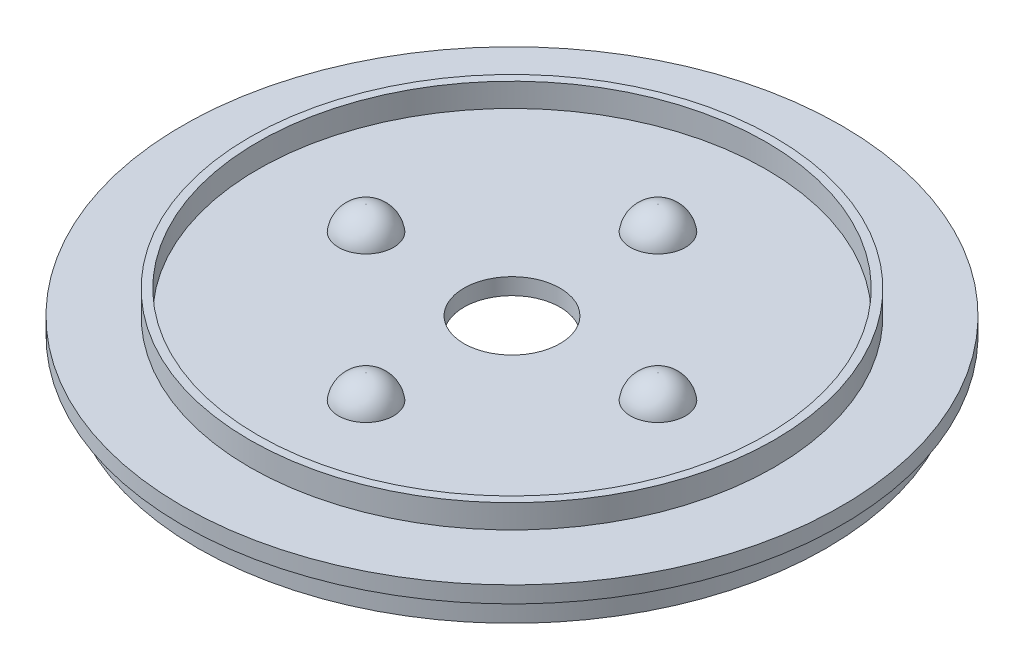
ISO-10303-21;
HEADER;
FILE_DESCRIPTION(('STEP AP214'),'2;1');
FILE_NAME('part.step','',(''),(''),'','','');
FILE_SCHEMA(('AUTOMOTIVE_DESIGN { 1 0 10303 214 1 1 1 1 }'));
ENDSEC;
DATA;
#1=APPLICATION_CONTEXT('core data for automotive mechanical design processes');
#2=APPLICATION_PROTOCOL_DEFINITION('international standard','automotive_design',2000,#1);
#3=PRODUCT_CONTEXT('',#1,'mechanical');
#4=PRODUCT('Part','Part','',(#3));
#5=PRODUCT_RELATED_PRODUCT_CATEGORY('part','',(#4));
#6=PRODUCT_DEFINITION_FORMATION('','',#4);
#7=PRODUCT_DEFINITION_CONTEXT('part definition',#1,'design');
#8=PRODUCT_DEFINITION('design','',#6,#7);
#9=PRODUCT_DEFINITION_SHAPE('','',#8);
#10=(LENGTH_UNIT() NAMED_UNIT(*) SI_UNIT(.MILLI.,.METRE.));
#11=(NAMED_UNIT(*) PLANE_ANGLE_UNIT() SI_UNIT($,.RADIAN.));
#12=(NAMED_UNIT(*) SI_UNIT($,.STERADIAN.) SOLID_ANGLE_UNIT());
#13=UNCERTAINTY_MEASURE_WITH_UNIT(LENGTH_MEASURE(1.E-05),#10,'distance_accuracy_value','');
#14=(GEOMETRIC_REPRESENTATION_CONTEXT(3) GLOBAL_UNCERTAINTY_ASSIGNED_CONTEXT((#13)) GLOBAL_UNIT_ASSIGNED_CONTEXT((#10,
#11,#12)) REPRESENTATION_CONTEXT('',''));
#15=CARTESIAN_POINT('',(0.,0.,0.));
#16=DIRECTION('',(0.,0.,1.));
#17=DIRECTION('',(1.,0.,0.));
#18=AXIS2_PLACEMENT_3D('',#15,#16,#17);
#19=CARTESIAN_POINT('',(0.,3.,0.));
#20=DIRECTION('',(0.,1.,0.));
#21=DIRECTION('',(0.,0.,1.));
#22=AXIS2_PLACEMENT_3D('',#19,#20,#21);
#23=PLANE('',#22);
#24=CARTESIAN_POINT('',(-26.5749612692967,3.,7.5014331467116E-13));
#25=DIRECTION('',(0.,1.,0.));
#26=DIRECTION('',(0.,0.,1.));
#27=AXIS2_PLACEMENT_3D('',#24,#25,#26);
#28=CIRCLE('',#27,5.00000000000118);
#29=CARTESIAN_POINT('',(-26.5749612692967,3.,5.00000000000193));
#30=VERTEX_POINT('',#29);
#31=EDGE_CURVE('E139',#30,#30,#28,.T.);
#32=ORIENTED_EDGE('',*,*,#31,.F.);
#33=EDGE_LOOP('',(#32));
#34=FACE_BOUND('',#33,.T.);
#35=CARTESIAN_POINT('',(1.49377764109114E-12,3.,26.5749612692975));
#36=DIRECTION('',(0.,1.,0.));
#37=DIRECTION('',(0.,0.,1.));
#38=AXIS2_PLACEMENT_3D('',#35,#36,#37);
#39=CIRCLE('',#38,5.00000000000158);
#40=CARTESIAN_POINT('',(1.49377764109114E-12,3.,31.574961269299));
#41=VERTEX_POINT('',#40);
#42=EDGE_CURVE('E135',#41,#41,#39,.T.);
#43=ORIENTED_EDGE('',*,*,#42,.F.);
#44=EDGE_LOOP('',(#43));
#45=FACE_BOUND('',#44,.T.);
#46=CARTESIAN_POINT('',(26.5749612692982,3.,-7.46888820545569E-13));
#47=DIRECTION('',(0.,1.,0.));
#48=DIRECTION('',(0.,0.,1.));
#49=AXIS2_PLACEMENT_3D('',#46,#47,#48);
#50=CIRCLE('',#49,5.00000000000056);
#51=CARTESIAN_POINT('',(26.5749612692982,3.,4.99999999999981));
#52=VERTEX_POINT('',#51);
#53=EDGE_CURVE('E131',#52,#52,#50,.T.);
#54=ORIENTED_EDGE('',*,*,#53,.F.);
#55=EDGE_LOOP('',(#54));
#56=FACE_BOUND('',#55,.T.);
#57=CARTESIAN_POINT('',(0.,3.,-26.5749612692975));
#58=DIRECTION('',(0.,1.,0.));
#59=DIRECTION('',(0.,0.,1.));
#60=AXIS2_PLACEMENT_3D('',#57,#58,#59);
#61=CIRCLE('',#60,5.);
#62=CARTESIAN_POINT('',(0.,3.,-21.5749612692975));
#63=VERTEX_POINT('',#62);
#64=EDGE_CURVE('E127',#63,#63,#61,.T.);
#65=ORIENTED_EDGE('',*,*,#64,.F.);
#66=EDGE_LOOP('',(#65));
#67=FACE_BOUND('',#66,.T.);
#68=CARTESIAN_POINT('',(0.,3.,0.));
#69=DIRECTION('',(0.,1.,0.));
#70=DIRECTION('',(0.,0.,1.));
#71=AXIS2_PLACEMENT_3D('',#68,#69,#70);
#72=CIRCLE('',#71,8.75);
#73=CARTESIAN_POINT('',(0.,3.,8.75));
#74=VERTEX_POINT('',#73);
#75=EDGE_CURVE('E80',#74,#74,#72,.T.);
#76=ORIENTED_EDGE('',*,*,#75,.F.);
#77=EDGE_LOOP('',(#76));
#78=FACE_BOUND('',#77,.T.);
#79=CARTESIAN_POINT('',(0.,3.,0.));
#80=DIRECTION('',(0.,1.,0.));
#81=DIRECTION('',(0.,0.,1.));
#82=AXIS2_PLACEMENT_3D('',#79,#80,#81);
#83=CIRCLE('',#82,46.25);
#84=CARTESIAN_POINT('',(0.,3.,-46.25));
#85=VERTEX_POINT('',#84);
#86=EDGE_CURVE('E63',#85,#85,#83,.F.);
#87=ORIENTED_EDGE('',*,*,#86,.F.);
#88=EDGE_LOOP('',(#87));
#89=FACE_BOUND('',#88,.T.);
#90=ADVANCED_FACE('F39',(#34,#45,#56,#67,#78,#89),#23,.T.);
#91=CARTESIAN_POINT('',(0.,0.,0.));
#92=DIRECTION('',(0.,1.,0.));
#93=DIRECTION('',(0.,0.,1.));
#94=AXIS2_PLACEMENT_3D('',#91,#92,#93);
#95=PLANE('',#94);
#96=CARTESIAN_POINT('',(0.,0.,0.));
#97=DIRECTION('',(0.,1.,0.));
#98=DIRECTION('',(0.,0.,1.));
#99=AXIS2_PLACEMENT_3D('',#96,#97,#98);
#100=CIRCLE('',#99,8.75);
#101=CARTESIAN_POINT('',(0.,0.,8.75));
#102=VERTEX_POINT('',#101);
#103=EDGE_CURVE('E84',#102,#102,#100,.T.);
#104=ORIENTED_EDGE('',*,*,#103,.T.);
#105=EDGE_LOOP('',(#104));
#106=FACE_BOUND('',#105,.T.);
#107=CARTESIAN_POINT('',(0.,0.,0.));
#108=DIRECTION('',(0.,-1.,0.));
#109=DIRECTION('',(0.,0.,-1.));
#110=AXIS2_PLACEMENT_3D('',#107,#108,#109);
#111=CIRCLE('',#110,20.5);
#112=CARTESIAN_POINT('',(0.,0.,-20.5));
#113=VERTEX_POINT('',#112);
#114=EDGE_CURVE('E108',#113,#113,#111,.T.);
#115=ORIENTED_EDGE('',*,*,#114,.T.);
#116=EDGE_LOOP('',(#115));
#117=FACE_BOUND('',#116,.T.);
#118=ADVANCED_FACE('F148',(#106,#117),#95,.F.);
#119=CARTESIAN_POINT('',(0.,0.,0.));
#120=DIRECTION('',(0.,1.,0.));
#121=DIRECTION('',(0.,0.,1.));
#122=AXIS2_PLACEMENT_3D('',#119,#120,#121);
#123=CIRCLE('',#122,22.);
#124=CARTESIAN_POINT('',(0.,0.,22.));
#125=VERTEX_POINT('',#124);
#126=EDGE_CURVE('E67',#125,#125,#123,.F.);
#127=ORIENTED_EDGE('',*,*,#126,.F.);
#128=EDGE_LOOP('',(#127));
#129=FACE_BOUND('',#128,.T.);
#130=CARTESIAN_POINT('',(0.,0.,0.));
#131=DIRECTION('',(0.,-1.,0.));
#132=DIRECTION('',(0.,0.,-1.));
#133=AXIS2_PLACEMENT_3D('',#130,#131,#132);
#134=CIRCLE('',#133,55.75);
#135=CARTESIAN_POINT('',(0.,0.,-55.75));
#136=VERTEX_POINT('',#135);
#137=EDGE_CURVE('E96',#136,#136,#134,.T.);
#138=ORIENTED_EDGE('',*,*,#137,.T.);
#139=EDGE_LOOP('',(#138));
#140=FACE_BOUND('',#139,.T.);
#141=ADVANCED_FACE('F212',(#129,#140),#95,.F.);
#142=CARTESIAN_POINT('',(0.,3.,0.));
#143=DIRECTION('',(0.,1.,0.));
#144=DIRECTION('',(0.,0.,1.));
#145=AXIS2_PLACEMENT_3D('',#142,#143,#144);
#146=CIRCLE('',#145,47.75);
#147=CARTESIAN_POINT('',(0.,3.,-47.75));
#148=VERTEX_POINT('',#147);
#149=EDGE_CURVE('E116',#148,#148,#146,.T.);
#150=ORIENTED_EDGE('',*,*,#149,.F.);
#151=EDGE_LOOP('',(#150));
#152=FACE_BOUND('',#151,.T.);
#153=CARTESIAN_POINT('',(0.,3.,0.));
#154=DIRECTION('',(0.,1.,0.));
#155=DIRECTION('',(0.,0.,1.));
#156=AXIS2_PLACEMENT_3D('',#153,#154,#155);
#157=CIRCLE('',#156,60.);
#158=CARTESIAN_POINT('',(0.,3.,60.));
#159=VERTEX_POINT('',#158);
#160=EDGE_CURVE('E75',#159,#159,#157,.T.);
#161=ORIENTED_EDGE('',*,*,#160,.T.);
#162=EDGE_LOOP('',(#161));
#163=FACE_BOUND('',#162,.T.);
#164=ADVANCED_FACE('F150',(#152,#163),#23,.T.);
#165=CARTESIAN_POINT('',(0.,0.,0.));
#166=DIRECTION('',(0.,1.,0.));
#167=DIRECTION('',(0.,0.,1.));
#168=AXIS2_PLACEMENT_3D('',#165,#166,#167);
#169=CIRCLE('',#168,57.25);
#170=CARTESIAN_POINT('',(0.,0.,57.25));
#171=VERTEX_POINT('',#170);
#172=EDGE_CURVE('E71',#171,#171,#169,.F.);
#173=ORIENTED_EDGE('',*,*,#172,.F.);
#174=EDGE_LOOP('',(#173));
#175=FACE_BOUND('',#174,.T.);
#176=CARTESIAN_POINT('',(0.,0.,0.));
#177=DIRECTION('',(0.,1.,0.));
#178=DIRECTION('',(0.,0.,1.));
#179=AXIS2_PLACEMENT_3D('',#176,#177,#178);
#180=CIRCLE('',#179,60.);
#181=CARTESIAN_POINT('',(0.,0.,60.));
#182=VERTEX_POINT('',#181);
#183=EDGE_CURVE('E76',#182,#182,#180,.T.);
#184=ORIENTED_EDGE('',*,*,#183,.F.);
#185=EDGE_LOOP('',(#184));
#186=FACE_BOUND('',#185,.T.);
#187=ADVANCED_FACE('F211',(#175,#186),#95,.F.);
#188=CARTESIAN_POINT('',(0.,3.,0.));
#189=DIRECTION('',(0.,-1.,0.));
#190=DIRECTION('',(0.,0.,-1.));
#191=AXIS2_PLACEMENT_3D('',#188,#189,#190);
#192=CYLINDRICAL_SURFACE('',#191,60.);
#193=ORIENTED_EDGE('',*,*,#160,.F.);
#194=EDGE_LOOP('',(#193));
#195=FACE_BOUND('',#194,.T.);
#196=ORIENTED_EDGE('',*,*,#183,.T.);
#197=EDGE_LOOP('',(#196));
#198=FACE_BOUND('',#197,.T.);
#199=ADVANCED_FACE('F207',(#195,#198),#192,.T.);
#200=CARTESIAN_POINT('',(0.,3.,0.));
#201=DIRECTION('',(0.,-1.,0.));
#202=DIRECTION('',(0.,0.,-1.));
#203=AXIS2_PLACEMENT_3D('',#200,#201,#202);
#204=CYLINDRICAL_SURFACE('',#203,8.75);
#205=ORIENTED_EDGE('',*,*,#75,.T.);
#206=EDGE_LOOP('',(#205));
#207=FACE_BOUND('',#206,.T.);
#208=ORIENTED_EDGE('',*,*,#103,.F.);
#209=EDGE_LOOP('',(#208));
#210=FACE_BOUND('',#209,.T.);
#211=ADVANCED_FACE('F201',(#207,#210),#204,.F.);
#212=CARTESIAN_POINT('',(0.,-5.,0.));
#213=DIRECTION('',(0.,-1.,0.));
#214=DIRECTION('',(0.,0.,-1.));
#215=AXIS2_PLACEMENT_3D('',#212,#213,#214);
#216=PLANE('',#215);
#217=CARTESIAN_POINT('',(0.,-5.,0.));
#218=DIRECTION('',(0.,-1.,0.));
#219=DIRECTION('',(0.,0.,-1.));
#220=AXIS2_PLACEMENT_3D('',#217,#218,#219);
#221=CIRCLE('',#220,57.25);
#222=CARTESIAN_POINT('',(0.,-5.,-57.25));
#223=VERTEX_POINT('',#222);
#224=EDGE_CURVE('E88',#223,#223,#221,.T.);
#225=ORIENTED_EDGE('',*,*,#224,.T.);
#226=EDGE_LOOP('',(#225));
#227=FACE_BOUND('',#226,.T.);
#228=CARTESIAN_POINT('',(0.,-5.,0.));
#229=DIRECTION('',(0.,-1.,0.));
#230=DIRECTION('',(0.,0.,-1.));
#231=AXIS2_PLACEMENT_3D('',#228,#229,#230);
#232=CIRCLE('',#231,55.75);
#233=CARTESIAN_POINT('',(0.,-5.,-55.75));
#234=VERTEX_POINT('',#233);
#235=EDGE_CURVE('E95',#234,#234,#232,.T.);
#236=ORIENTED_EDGE('',*,*,#235,.F.);
#237=EDGE_LOOP('',(#236));
#238=FACE_BOUND('',#237,.T.);
#239=ADVANCED_FACE('F198',(#227,#238),#216,.T.);
#240=CARTESIAN_POINT('',(0.,-5.,0.));
#241=DIRECTION('',(0.,1.,0.));
#242=DIRECTION('',(0.,0.,1.));
#243=AXIS2_PLACEMENT_3D('',#240,#241,#242);
#244=CYLINDRICAL_SURFACE('',#243,57.25);
#245=ORIENTED_EDGE('',*,*,#224,.F.);
#246=EDGE_LOOP('',(#245));
#247=FACE_BOUND('',#246,.T.);
#248=ORIENTED_EDGE('',*,*,#172,.T.);
#249=EDGE_LOOP('',(#248));
#250=FACE_BOUND('',#249,.T.);
#251=ADVANCED_FACE('F196',(#247,#250),#244,.T.);
#252=CARTESIAN_POINT('',(0.,-5.,0.));
#253=DIRECTION('',(0.,1.,0.));
#254=DIRECTION('',(0.,0.,1.));
#255=AXIS2_PLACEMENT_3D('',#252,#253,#254);
#256=CYLINDRICAL_SURFACE('',#255,55.75);
#257=ORIENTED_EDGE('',*,*,#235,.T.);
#258=EDGE_LOOP('',(#257));
#259=FACE_BOUND('',#258,.T.);
#260=ORIENTED_EDGE('',*,*,#137,.F.);
#261=EDGE_LOOP('',(#260));
#262=FACE_BOUND('',#261,.T.);
#263=ADVANCED_FACE('F189',(#259,#262),#256,.F.);
#264=CARTESIAN_POINT('',(0.,-7.,0.));
#265=DIRECTION('',(0.,-1.,0.));
#266=DIRECTION('',(0.,0.,-1.));
#267=AXIS2_PLACEMENT_3D('',#264,#265,#266);
#268=PLANE('',#267);
#269=CARTESIAN_POINT('',(0.,-7.,0.));
#270=DIRECTION('',(0.,-1.,0.));
#271=DIRECTION('',(0.,0.,-1.));
#272=AXIS2_PLACEMENT_3D('',#269,#270,#271);
#273=CIRCLE('',#272,22.);
#274=CARTESIAN_POINT('',(0.,-7.,-22.));
#275=VERTEX_POINT('',#274);
#276=EDGE_CURVE('E100',#275,#275,#273,.T.);
#277=ORIENTED_EDGE('',*,*,#276,.T.);
#278=EDGE_LOOP('',(#277));
#279=FACE_BOUND('',#278,.T.);
#280=CARTESIAN_POINT('',(0.,-7.,0.));
#281=DIRECTION('',(0.,-1.,0.));
#282=DIRECTION('',(0.,0.,-1.));
#283=AXIS2_PLACEMENT_3D('',#280,#281,#282);
#284=CIRCLE('',#283,20.5);
#285=CARTESIAN_POINT('',(0.,-7.,-20.5));
#286=VERTEX_POINT('',#285);
#287=EDGE_CURVE('E107',#286,#286,#284,.T.);
#288=ORIENTED_EDGE('',*,*,#287,.F.);
#289=EDGE_LOOP('',(#288));
#290=FACE_BOUND('',#289,.T.);
#291=ADVANCED_FACE('F186',(#279,#290),#268,.T.);
#292=CARTESIAN_POINT('',(0.,-7.,0.));
#293=DIRECTION('',(0.,1.,0.));
#294=DIRECTION('',(0.,0.,1.));
#295=AXIS2_PLACEMENT_3D('',#292,#293,#294);
#296=CYLINDRICAL_SURFACE('',#295,22.);
#297=ORIENTED_EDGE('',*,*,#276,.F.);
#298=EDGE_LOOP('',(#297));
#299=FACE_BOUND('',#298,.T.);
#300=ORIENTED_EDGE('',*,*,#126,.T.);
#301=EDGE_LOOP('',(#300));
#302=FACE_BOUND('',#301,.T.);
#303=ADVANCED_FACE('F184',(#299,#302),#296,.T.);
#304=CARTESIAN_POINT('',(0.,-7.,0.));
#305=DIRECTION('',(0.,1.,0.));
#306=DIRECTION('',(0.,0.,1.));
#307=AXIS2_PLACEMENT_3D('',#304,#305,#306);
#308=CYLINDRICAL_SURFACE('',#307,20.5);
#309=ORIENTED_EDGE('',*,*,#287,.T.);
#310=EDGE_LOOP('',(#309));
#311=FACE_BOUND('',#310,.T.);
#312=ORIENTED_EDGE('',*,*,#114,.F.);
#313=EDGE_LOOP('',(#312));
#314=FACE_BOUND('',#313,.T.);
#315=ADVANCED_FACE('F179',(#311,#314),#308,.F.);
#316=CARTESIAN_POINT('',(0.,7.3,0.));
#317=DIRECTION('',(0.,1.,0.));
#318=DIRECTION('',(0.,0.,1.));
#319=AXIS2_PLACEMENT_3D('',#316,#317,#318);
#320=PLANE('',#319);
#321=CARTESIAN_POINT('',(0.,7.3,0.));
#322=DIRECTION('',(0.,1.,0.));
#323=DIRECTION('',(0.,0.,1.));
#324=AXIS2_PLACEMENT_3D('',#321,#322,#323);
#325=CIRCLE('',#324,47.75);
#326=CARTESIAN_POINT('',(0.,7.3,-47.75));
#327=VERTEX_POINT('',#326);
#328=EDGE_CURVE('E112',#327,#327,#325,.T.);
#329=ORIENTED_EDGE('',*,*,#328,.T.);
#330=EDGE_LOOP('',(#329));
#331=FACE_BOUND('',#330,.T.);
#332=CARTESIAN_POINT('',(0.,7.3,0.));
#333=DIRECTION('',(0.,1.,0.));
#334=DIRECTION('',(0.,0.,1.));
#335=AXIS2_PLACEMENT_3D('',#332,#333,#334);
#336=CIRCLE('',#335,46.25);
#337=CARTESIAN_POINT('',(0.,7.3,-46.25));
#338=VERTEX_POINT('',#337);
#339=EDGE_CURVE('E120',#338,#338,#336,.T.);
#340=ORIENTED_EDGE('',*,*,#339,.F.);
#341=EDGE_LOOP('',(#340));
#342=FACE_BOUND('',#341,.T.);
#343=ADVANCED_FACE('F173',(#331,#342),#320,.T.);
#344=CARTESIAN_POINT('',(0.,7.3,0.));
#345=DIRECTION('',(0.,-1.,0.));
#346=DIRECTION('',(0.,0.,-1.));
#347=AXIS2_PLACEMENT_3D('',#344,#345,#346);
#348=CYLINDRICAL_SURFACE('',#347,47.75);
#349=CARTESIAN_POINT('',(0.,7.3,-47.75));
#350=CARTESIAN_POINT('',(0.,7.25520833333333,-47.75));
#351=CARTESIAN_POINT('',(0.,7.21041666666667,-47.75));
#352=CARTESIAN_POINT('',(0.,7.12083333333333,-47.75));
#353=CARTESIAN_POINT('',(0.,7.07604166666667,-47.75));
#354=CARTESIAN_POINT('',(0.,6.98645833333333,-47.75));
#355=CARTESIAN_POINT('',(0.,6.94166666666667,-47.75));
#356=CARTESIAN_POINT('',(0.,6.85208333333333,-47.75));
#357=CARTESIAN_POINT('',(0.,6.80729166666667,-47.75));
#358=CARTESIAN_POINT('',(0.,6.71770833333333,-47.75));
#359=CARTESIAN_POINT('',(0.,6.67291666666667,-47.75));
#360=CARTESIAN_POINT('',(0.,6.58333333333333,-47.75));
#361=CARTESIAN_POINT('',(0.,6.53854166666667,-47.75));
#362=CARTESIAN_POINT('',(0.,6.44895833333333,-47.75));
#363=CARTESIAN_POINT('',(0.,6.40416666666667,-47.75));
#364=CARTESIAN_POINT('',(0.,6.31458333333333,-47.75));
#365=CARTESIAN_POINT('',(0.,6.26979166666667,-47.75));
#366=CARTESIAN_POINT('',(0.,6.18020833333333,-47.75));
#367=CARTESIAN_POINT('',(0.,6.13541666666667,-47.75));
#368=CARTESIAN_POINT('',(0.,6.04583333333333,-47.75));
#369=CARTESIAN_POINT('',(0.,6.00104166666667,-47.75));
#370=CARTESIAN_POINT('',(0.,5.91145833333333,-47.75));
#371=CARTESIAN_POINT('',(0.,5.86666666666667,-47.75));
#372=CARTESIAN_POINT('',(0.,5.77708333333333,-47.75));
#373=CARTESIAN_POINT('',(0.,5.73229166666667,-47.75));
#374=CARTESIAN_POINT('',(0.,5.64270833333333,-47.75));
#375=CARTESIAN_POINT('',(0.,5.59791666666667,-47.75));
#376=CARTESIAN_POINT('',(0.,5.50833333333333,-47.75));
#377=CARTESIAN_POINT('',(0.,5.46354166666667,-47.75));
#378=CARTESIAN_POINT('',(0.,5.37395833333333,-47.75));
#379=CARTESIAN_POINT('',(0.,5.32916666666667,-47.75));
#380=CARTESIAN_POINT('',(0.,5.23958333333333,-47.75));
#381=CARTESIAN_POINT('',(0.,5.19479166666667,-47.75));
#382=CARTESIAN_POINT('',(0.,5.10520833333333,-47.75));
#383=CARTESIAN_POINT('',(0.,5.06041666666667,-47.75));
#384=CARTESIAN_POINT('',(0.,4.97083333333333,-47.75));
#385=CARTESIAN_POINT('',(0.,4.92604166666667,-47.75));
#386=CARTESIAN_POINT('',(0.,4.83645833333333,-47.75));
#387=CARTESIAN_POINT('',(0.,4.79166666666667,-47.75));
#388=CARTESIAN_POINT('',(0.,4.70208333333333,-47.75));
#389=CARTESIAN_POINT('',(0.,4.65729166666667,-47.75));
#390=CARTESIAN_POINT('',(0.,4.56770833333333,-47.75));
#391=CARTESIAN_POINT('',(0.,4.52291666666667,-47.75));
#392=CARTESIAN_POINT('',(0.,4.43333333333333,-47.75));
#393=CARTESIAN_POINT('',(0.,4.38854166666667,-47.75));
#394=CARTESIAN_POINT('',(0.,4.29895833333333,-47.75));
#395=CARTESIAN_POINT('',(0.,4.25416666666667,-47.75));
#396=CARTESIAN_POINT('',(0.,4.16458333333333,-47.75));
#397=CARTESIAN_POINT('',(0.,4.11979166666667,-47.75));
#398=CARTESIAN_POINT('',(0.,4.03020833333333,-47.75));
#399=CARTESIAN_POINT('',(0.,3.98541666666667,-47.75));
#400=CARTESIAN_POINT('',(0.,3.89583333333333,-47.75));
#401=CARTESIAN_POINT('',(0.,3.85104166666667,-47.75));
#402=CARTESIAN_POINT('',(0.,3.76145833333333,-47.75));
#403=CARTESIAN_POINT('',(0.,3.71666666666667,-47.75));
#404=CARTESIAN_POINT('',(0.,3.62708333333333,-47.75));
#405=CARTESIAN_POINT('',(0.,3.58229166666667,-47.75));
#406=CARTESIAN_POINT('',(0.,3.49270833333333,-47.75));
#407=CARTESIAN_POINT('',(0.,3.44791666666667,-47.75));
#408=CARTESIAN_POINT('',(0.,3.35833333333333,-47.75));
#409=CARTESIAN_POINT('',(0.,3.31354166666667,-47.75));
#410=CARTESIAN_POINT('',(0.,3.22395833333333,-47.75));
#411=CARTESIAN_POINT('',(0.,3.17916666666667,-47.75));
#412=CARTESIAN_POINT('',(0.,3.08958333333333,-47.75));
#413=CARTESIAN_POINT('',(0.,3.04479166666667,-47.75));
#414=CARTESIAN_POINT('',(0.,3.,-47.75));
#415=B_SPLINE_CURVE_WITH_KNOTS('',3,(#349,#350,#351,#352,#353,#354,#355,#356,#357,#358,#359,
#360,#361,#362,#363,#364,#365,#366,#367,#368,#369,#370,#371,#372,#373,#374,#375,#376,#377,#378,
#379,#380,#381,#382,#383,#384,#385,#386,#387,#388,#389,#390,#391,#392,#393,#394,#395,#396,#397,
#398,#399,#400,#401,#402,#403,#404,#405,#406,#407,#408,#409,#410,#411,#412,#413,#414),
.UNSPECIFIED.,.F.,.F.,(4,2,2,2,2,2,2,2,2,2,2,2,2,2,2,2,2,2,2,2,2,2,2,2,2,2,2,2,2,2,2,2,4),(0.,
0.134375,0.26875,0.403125,0.5375,0.671875,0.80625,0.940625,1.075,1.209375,1.34375,1.478125,
1.6125,1.746875,1.88125,2.015625,2.15,2.284375,2.41875,2.553125,2.6875,2.821875,2.95625,
3.090625,3.225,3.359375,3.49375,3.628125,3.7625,3.896875,4.03125,4.165625,4.3),.UNSPECIFIED.);
#416=EDGE_CURVE('BSEAM164',#327,#148,#415,.T.);
#417=ORIENTED_EDGE('',*,*,#328,.F.);
#418=ORIENTED_EDGE('',*,*,#149,.T.);
#419=ORIENTED_EDGE('',*,*,#416,.T.);
#420=ORIENTED_EDGE('',*,*,#416,.F.);
#421=EDGE_LOOP('',(#417,#419,#418,#420));
#422=FACE_BOUND('',#421,.T.);
#423=ADVANCED_FACE('F164',(#422),#348,.T.);
#424=CARTESIAN_POINT('',(0.,7.3,0.));
#425=DIRECTION('',(0.,-1.,0.));
#426=DIRECTION('',(0.,0.,-1.));
#427=AXIS2_PLACEMENT_3D('',#424,#425,#426);
#428=CYLINDRICAL_SURFACE('',#427,46.25);
#429=CARTESIAN_POINT('',(0.,7.3,-46.25));
#430=CARTESIAN_POINT('',(0.,7.25520833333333,-46.25));
#431=CARTESIAN_POINT('',(0.,7.21041666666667,-46.25));
#432=CARTESIAN_POINT('',(0.,7.12083333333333,-46.25));
#433=CARTESIAN_POINT('',(0.,7.07604166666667,-46.25));
#434=CARTESIAN_POINT('',(0.,6.98645833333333,-46.25));
#435=CARTESIAN_POINT('',(0.,6.94166666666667,-46.25));
#436=CARTESIAN_POINT('',(0.,6.85208333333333,-46.25));
#437=CARTESIAN_POINT('',(0.,6.80729166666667,-46.25));
#438=CARTESIAN_POINT('',(0.,6.71770833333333,-46.25));
#439=CARTESIAN_POINT('',(0.,6.67291666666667,-46.25));
#440=CARTESIAN_POINT('',(0.,6.58333333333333,-46.25));
#441=CARTESIAN_POINT('',(0.,6.53854166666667,-46.25));
#442=CARTESIAN_POINT('',(0.,6.44895833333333,-46.25));
#443=CARTESIAN_POINT('',(0.,6.40416666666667,-46.25));
#444=CARTESIAN_POINT('',(0.,6.31458333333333,-46.25));
#445=CARTESIAN_POINT('',(0.,6.26979166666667,-46.25));
#446=CARTESIAN_POINT('',(0.,6.18020833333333,-46.25));
#447=CARTESIAN_POINT('',(0.,6.13541666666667,-46.25));
#448=CARTESIAN_POINT('',(0.,6.04583333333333,-46.25));
#449=CARTESIAN_POINT('',(0.,6.00104166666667,-46.25));
#450=CARTESIAN_POINT('',(0.,5.91145833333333,-46.25));
#451=CARTESIAN_POINT('',(0.,5.86666666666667,-46.25));
#452=CARTESIAN_POINT('',(0.,5.77708333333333,-46.25));
#453=CARTESIAN_POINT('',(0.,5.73229166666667,-46.25));
#454=CARTESIAN_POINT('',(0.,5.64270833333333,-46.25));
#455=CARTESIAN_POINT('',(0.,5.59791666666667,-46.25));
#456=CARTESIAN_POINT('',(0.,5.50833333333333,-46.25));
#457=CARTESIAN_POINT('',(0.,5.46354166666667,-46.25));
#458=CARTESIAN_POINT('',(0.,5.37395833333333,-46.25));
#459=CARTESIAN_POINT('',(0.,5.32916666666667,-46.25));
#460=CARTESIAN_POINT('',(0.,5.23958333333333,-46.25));
#461=CARTESIAN_POINT('',(0.,5.19479166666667,-46.25));
#462=CARTESIAN_POINT('',(0.,5.10520833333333,-46.25));
#463=CARTESIAN_POINT('',(0.,5.06041666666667,-46.25));
#464=CARTESIAN_POINT('',(0.,4.97083333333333,-46.25));
#465=CARTESIAN_POINT('',(0.,4.92604166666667,-46.25));
#466=CARTESIAN_POINT('',(0.,4.83645833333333,-46.25));
#467=CARTESIAN_POINT('',(0.,4.79166666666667,-46.25));
#468=CARTESIAN_POINT('',(0.,4.70208333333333,-46.25));
#469=CARTESIAN_POINT('',(0.,4.65729166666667,-46.25));
#470=CARTESIAN_POINT('',(0.,4.56770833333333,-46.25));
#471=CARTESIAN_POINT('',(0.,4.52291666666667,-46.25));
#472=CARTESIAN_POINT('',(0.,4.43333333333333,-46.25));
#473=CARTESIAN_POINT('',(0.,4.38854166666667,-46.25));
#474=CARTESIAN_POINT('',(0.,4.29895833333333,-46.25));
#475=CARTESIAN_POINT('',(0.,4.25416666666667,-46.25));
#476=CARTESIAN_POINT('',(0.,4.16458333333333,-46.25));
#477=CARTESIAN_POINT('',(0.,4.11979166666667,-46.25));
#478=CARTESIAN_POINT('',(0.,4.03020833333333,-46.25));
#479=CARTESIAN_POINT('',(0.,3.98541666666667,-46.25));
#480=CARTESIAN_POINT('',(0.,3.89583333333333,-46.25));
#481=CARTESIAN_POINT('',(0.,3.85104166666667,-46.25));
#482=CARTESIAN_POINT('',(0.,3.76145833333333,-46.25));
#483=CARTESIAN_POINT('',(0.,3.71666666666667,-46.25));
#484=CARTESIAN_POINT('',(0.,3.62708333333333,-46.25));
#485=CARTESIAN_POINT('',(0.,3.58229166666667,-46.25));
#486=CARTESIAN_POINT('',(0.,3.49270833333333,-46.25));
#487=CARTESIAN_POINT('',(0.,3.44791666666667,-46.25));
#488=CARTESIAN_POINT('',(0.,3.35833333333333,-46.25));
#489=CARTESIAN_POINT('',(0.,3.31354166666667,-46.25));
#490=CARTESIAN_POINT('',(0.,3.22395833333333,-46.25));
#491=CARTESIAN_POINT('',(0.,3.17916666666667,-46.25));
#492=CARTESIAN_POINT('',(0.,3.08958333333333,-46.25));
#493=CARTESIAN_POINT('',(0.,3.04479166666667,-46.25));
#494=CARTESIAN_POINT('',(0.,3.,-46.25));
#495=B_SPLINE_CURVE_WITH_KNOTS('',3,(#429,#430,#431,#432,#433,#434,#435,#436,#437,#438,#439,
#440,#441,#442,#443,#444,#445,#446,#447,#448,#449,#450,#451,#452,#453,#454,#455,#456,#457,#458,
#459,#460,#461,#462,#463,#464,#465,#466,#467,#468,#469,#470,#471,#472,#473,#474,#475,#476,#477,
#478,#479,#480,#481,#482,#483,#484,#485,#486,#487,#488,#489,#490,#491,#492,#493,#494),
.UNSPECIFIED.,.F.,.F.,(4,2,2,2,2,2,2,2,2,2,2,2,2,2,2,2,2,2,2,2,2,2,2,2,2,2,2,2,2,2,2,2,4),(0.,
0.134375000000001,0.268750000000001,0.403125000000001,0.537500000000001,0.671875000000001,
0.806250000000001,0.940625,1.075,1.209375,1.34375,1.478125,1.6125,1.746875,1.88125,2.015625,
2.15,2.284375,2.41875,2.553125,2.6875,2.821875,2.95625,3.090625,3.225,3.359375,3.49375,3.628125,
3.7625,3.896875,4.03125,4.165625,4.3),.UNSPECIFIED.);
#496=EDGE_CURVE('BSEAM161',#338,#85,#495,.T.);
#497=ORIENTED_EDGE('',*,*,#339,.T.);
#498=ORIENTED_EDGE('',*,*,#86,.T.);
#499=ORIENTED_EDGE('',*,*,#496,.T.);
#500=ORIENTED_EDGE('',*,*,#496,.F.);
#501=EDGE_LOOP('',(#497,#499,#498,#500));
#502=FACE_BOUND('',#501,.T.);
#503=ADVANCED_FACE('F161',(#502),#428,.F.);
#504=CARTESIAN_POINT('',(0.,7.3,0.));
#505=DIRECTION('',(0.,1.,0.));
#506=DIRECTION('',(0.,0.,1.));
#507=AXIS2_PLACEMENT_3D('',#504,#505,#506);
#508=PLANE('',#507);
#509=CARTESIAN_POINT('',(0.,7.3,-26.5749612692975));
#510=DIRECTION('',(0.,1.,0.));
#511=DIRECTION('',(0.,0.,1.));
#512=AXIS2_PLACEMENT_3D('',#509,#510,#511);
#513=CIRCLE('',#512,0.049242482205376);
#514=CARTESIAN_POINT('',(0.,7.3,-26.5257187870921));
#515=VERTEX_POINT('',#514);
#516=EDGE_CURVE('E47',#515,#515,#513,.T.);
#517=ORIENTED_EDGE('',*,*,#516,.T.);
#518=EDGE_LOOP('',(#517));
#519=FACE_BOUND('',#518,.T.);
#520=ADVANCED_FACE('F163',(#519),#508,.T.);
#521=CARTESIAN_POINT('',(0.,7.3,0.));
#522=DIRECTION('',(0.,1.,0.));
#523=DIRECTION('',(0.,0.,1.));
#524=AXIS2_PLACEMENT_3D('',#521,#522,#523);
#525=PLANE('',#524);
#526=CARTESIAN_POINT('',(26.5749612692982,7.3,-7.46888820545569E-13));
#527=DIRECTION('',(0.,1.,0.));
#528=DIRECTION('',(0.,0.,1.));
#529=AXIS2_PLACEMENT_3D('',#526,#527,#528);
#530=CIRCLE('',#529,0.0492424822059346);
#531=CARTESIAN_POINT('',(26.5749612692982,7.3,0.0492424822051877));
#532=VERTEX_POINT('',#531);
#533=EDGE_CURVE('E52',#532,#532,#530,.T.);
#534=ORIENTED_EDGE('',*,*,#533,.T.);
#535=EDGE_LOOP('',(#534));
#536=FACE_BOUND('',#535,.T.);
#537=ADVANCED_FACE('F171',(#536),#525,.T.);
#538=CARTESIAN_POINT('',(0.,7.3,0.));
#539=DIRECTION('',(0.,1.,0.));
#540=DIRECTION('',(0.,0.,1.));
#541=AXIS2_PLACEMENT_3D('',#538,#539,#540);
#542=PLANE('',#541);
#543=CARTESIAN_POINT('',(1.49377764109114E-12,7.3,26.5749612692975));
#544=DIRECTION('',(0.,1.,0.));
#545=DIRECTION('',(0.,0.,1.));
#546=AXIS2_PLACEMENT_3D('',#543,#544,#545);
#547=CIRCLE('',#546,0.0492424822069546);
#548=CARTESIAN_POINT('',(1.49377764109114E-12,7.3,26.6242037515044));
#549=VERTEX_POINT('',#548);
#550=EDGE_CURVE('E57',#549,#549,#547,.T.);
#551=ORIENTED_EDGE('',*,*,#550,.T.);
#552=EDGE_LOOP('',(#551));
#553=FACE_BOUND('',#552,.T.);
#554=ADVANCED_FACE('F269',(#553),#542,.T.);
#555=CARTESIAN_POINT('',(0.,7.3,0.));
#556=DIRECTION('',(0.,1.,0.));
#557=DIRECTION('',(0.,0.,1.));
#558=AXIS2_PLACEMENT_3D('',#555,#556,#557);
#559=PLANE('',#558);
#560=CARTESIAN_POINT('',(-26.5749612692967,7.3,7.5014331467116E-13));
#561=DIRECTION('',(0.,1.,0.));
#562=DIRECTION('',(0.,0.,1.));
#563=AXIS2_PLACEMENT_3D('',#560,#561,#562);
#564=CIRCLE('',#563,0.0492424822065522);
#565=CARTESIAN_POINT('',(-26.5749612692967,7.3,0.0492424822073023));
#566=VERTEX_POINT('',#565);
#567=EDGE_CURVE('E10',#566,#566,#564,.T.);
#568=ORIENTED_EDGE('',*,*,#567,.T.);
#569=EDGE_LOOP('',(#568));
#570=FACE_BOUND('',#569,.T.);
#571=ADVANCED_FACE('F224',(#570),#559,.T.);
#572=CARTESIAN_POINT('',(1.49377764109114E-12,2.3,26.5749612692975));
#573=DIRECTION('',(0.,-1.,0.));
#574=DIRECTION('',(0.,0.,-1.));
#575=AXIS2_PLACEMENT_3D('',#572,#573,#574);
#576=DEGENERATE_TOROIDAL_SURFACE('',#575,0.0492424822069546,5.,.T.);
#577=ORIENTED_EDGE('',*,*,#42,.T.);
#578=EDGE_LOOP('',(#577));
#579=FACE_BOUND('',#578,.T.);
#580=ORIENTED_EDGE('',*,*,#550,.F.);
#581=EDGE_LOOP('',(#580));
#582=FACE_BOUND('',#581,.T.);
#583=ADVANCED_FACE('F220',(#579,#582),#576,.T.);
#584=CARTESIAN_POINT('',(26.5749612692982,2.3,-7.46888820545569E-13));
#585=DIRECTION('',(0.,-1.,0.));
#586=DIRECTION('',(0.,0.,-1.));
#587=AXIS2_PLACEMENT_3D('',#584,#585,#586);
#588=DEGENERATE_TOROIDAL_SURFACE('',#587,0.0492424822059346,5.,.T.);
#589=ORIENTED_EDGE('',*,*,#53,.T.);
#590=EDGE_LOOP('',(#589));
#591=FACE_BOUND('',#590,.T.);
#592=ORIENTED_EDGE('',*,*,#533,.F.);
#593=EDGE_LOOP('',(#592));
#594=FACE_BOUND('',#593,.T.);
#595=ADVANCED_FACE('F223',(#591,#594),#588,.T.);
#596=CARTESIAN_POINT('',(0.,2.3,-26.5749612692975));
#597=DIRECTION('',(0.,-1.,0.));
#598=DIRECTION('',(0.,0.,-1.));
#599=AXIS2_PLACEMENT_3D('',#596,#597,#598);
#600=DEGENERATE_TOROIDAL_SURFACE('',#599,0.049242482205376,5.,.T.);
#601=ORIENTED_EDGE('',*,*,#64,.T.);
#602=EDGE_LOOP('',(#601));
#603=FACE_BOUND('',#602,.T.);
#604=ORIENTED_EDGE('',*,*,#516,.F.);
#605=EDGE_LOOP('',(#604));
#606=FACE_BOUND('',#605,.T.);
#607=ADVANCED_FACE('F227',(#603,#606),#600,.T.);
#608=CARTESIAN_POINT('',(-26.5749612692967,2.3,7.5014331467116E-13));
#609=DIRECTION('',(0.,-1.,0.));
#610=DIRECTION('',(0.,0.,-1.));
#611=AXIS2_PLACEMENT_3D('',#608,#609,#610);
#612=DEGENERATE_TOROIDAL_SURFACE('',#611,0.0492424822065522,5.,.T.);
#613=ORIENTED_EDGE('',*,*,#31,.T.);
#614=EDGE_LOOP('',(#613));
#615=FACE_BOUND('',#614,.T.);
#616=ORIENTED_EDGE('',*,*,#567,.F.);
#617=EDGE_LOOP('',(#616));
#618=FACE_BOUND('',#617,.T.);
#619=ADVANCED_FACE('F41',(#615,#618),#612,.T.);
#620=CLOSED_SHELL('',(#90,#118,#141,#164,#187,#199,#211,#239,#251,#263,#291,#303,#315,#343,#423,
#503,#520,#537,#554,#571,#583,#595,#607,#619));
#621=MANIFOLD_SOLID_BREP('B2',#620);
#622=ADVANCED_BREP_SHAPE_REPRESENTATION('',(#18,#621),#14);
#623=SHAPE_DEFINITION_REPRESENTATION(#9,#622);
ENDSEC;
END-ISO-10303-21;
